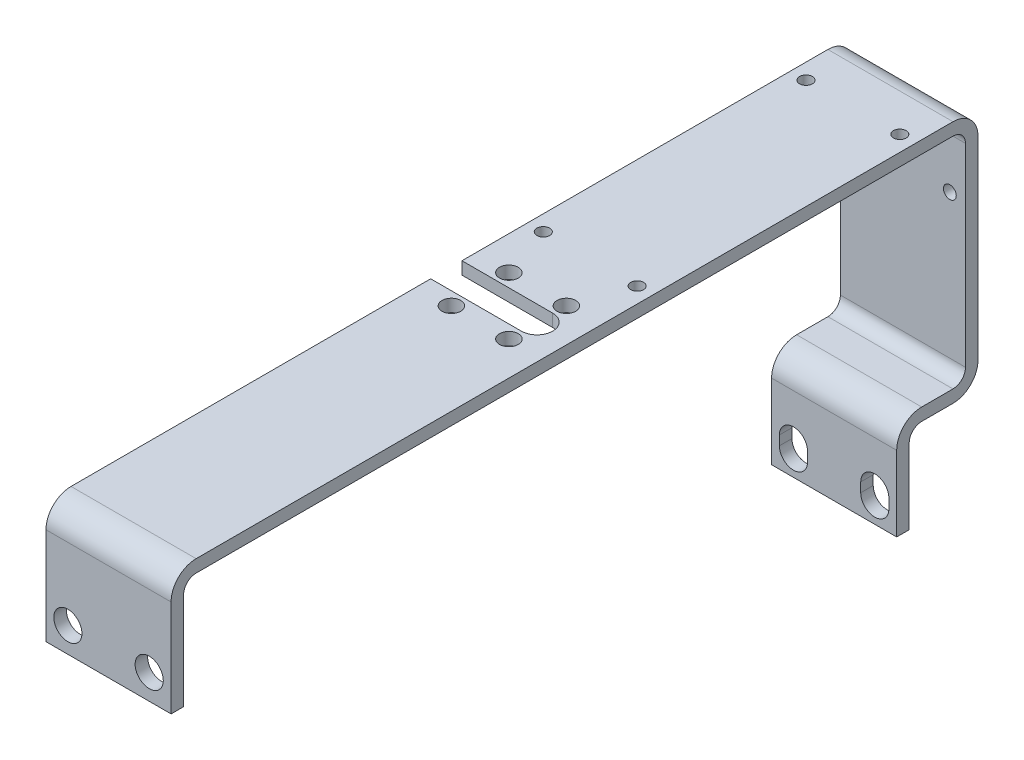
ISO-10303-21;
HEADER;
FILE_DESCRIPTION(('STEP AP214'),'2;1');
FILE_NAME('part.step','',(''),(''),'','','');
FILE_SCHEMA(('AUTOMOTIVE_DESIGN { 1 0 10303 214 1 1 1 1 }'));
ENDSEC;
DATA;
#1=APPLICATION_CONTEXT('core data for automotive mechanical design processes');
#2=APPLICATION_PROTOCOL_DEFINITION('international standard','automotive_design',2000,#1);
#3=PRODUCT_CONTEXT('',#1,'mechanical');
#4=PRODUCT('Part','Part','',(#3));
#5=PRODUCT_RELATED_PRODUCT_CATEGORY('part','',(#4));
#6=PRODUCT_DEFINITION_FORMATION('','',#4);
#7=PRODUCT_DEFINITION_CONTEXT('part definition',#1,'design');
#8=PRODUCT_DEFINITION('design','',#6,#7);
#9=PRODUCT_DEFINITION_SHAPE('','',#8);
#10=(LENGTH_UNIT() NAMED_UNIT(*) SI_UNIT(.MILLI.,.METRE.));
#11=(NAMED_UNIT(*) PLANE_ANGLE_UNIT() SI_UNIT($,.RADIAN.));
#12=(NAMED_UNIT(*) SI_UNIT($,.STERADIAN.) SOLID_ANGLE_UNIT());
#13=UNCERTAINTY_MEASURE_WITH_UNIT(LENGTH_MEASURE(1.E-05),#10,'distance_accuracy_value','');
#14=(GEOMETRIC_REPRESENTATION_CONTEXT(3) GLOBAL_UNCERTAINTY_ASSIGNED_CONTEXT((#13)) GLOBAL_UNIT_ASSIGNED_CONTEXT((#10,
#11,#12)) REPRESENTATION_CONTEXT('',''));
#15=CARTESIAN_POINT('',(0.,0.,0.));
#16=DIRECTION('',(0.,0.,1.));
#17=DIRECTION('',(1.,0.,0.));
#18=AXIS2_PLACEMENT_3D('',#15,#16,#17);
#19=CARTESIAN_POINT('',(0.,12.,-4.));
#20=DIRECTION('',(-1.,0.,0.));
#21=DIRECTION('',(0.,0.,1.));
#22=AXIS2_PLACEMENT_3D('',#19,#20,#21);
#23=PLANE('',#22);
#24=DIRECTION('',(0.,1.,0.));
#25=VECTOR('',#24,1.);
#26=CARTESIAN_POINT('',(0.,0.,49.5));
#27=LINE('',#26,#25);
#28=CARTESIAN_POINT('',(0.,51.,49.5));
#29=VERTEX_POINT('',#28);
#30=CARTESIAN_POINT('',(0.,53.,49.5));
#31=VERTEX_POINT('',#30);
#32=EDGE_CURVE('E254',#29,#31,#27,.T.);
#33=ORIENTED_EDGE('',*,*,#32,.T.);
#34=DIRECTION('',(0.,0.,1.));
#35=VECTOR('',#34,1.);
#36=CARTESIAN_POINT('',(0.,53.,-9.00000000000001));
#37=LINE('',#36,#35);
#38=CARTESIAN_POINT('',(0.,53.,-9.00000000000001));
#39=VERTEX_POINT('',#38);
#40=EDGE_CURVE('E268',#39,#31,#37,.T.);
#41=ORIENTED_EDGE('',*,*,#40,.F.);
#42=CARTESIAN_POINT('',(0.,49.,-9.00000000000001));
#43=DIRECTION('',(1.,0.,0.));
#44=DIRECTION('',(0.,0.,-1.));
#45=AXIS2_PLACEMENT_3D('',#42,#43,#44);
#46=CIRCLE('',#45,4.);
#47=CARTESIAN_POINT('',(0.,49.,-13.));
#48=VERTEX_POINT('',#47);
#49=EDGE_CURVE('E282',#48,#39,#46,.T.);
#50=ORIENTED_EDGE('',*,*,#49,.F.);
#51=DIRECTION('',(0.,1.,0.));
#52=VECTOR('',#51,1.);
#53=CARTESIAN_POINT('',(0.,49.,-13.));
#54=LINE('',#53,#52);
#55=CARTESIAN_POINT('',(0.,18.,-13.));
#56=VERTEX_POINT('',#55);
#57=EDGE_CURVE('E367',#56,#48,#54,.T.);
#58=ORIENTED_EDGE('',*,*,#57,.F.);
#59=CARTESIAN_POINT('',(0.,18.,-9.00000000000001));
#60=DIRECTION('',(1.,0.,0.));
#61=DIRECTION('',(0.,0.,1.));
#62=AXIS2_PLACEMENT_3D('',#59,#60,#61);
#63=CIRCLE('',#62,4.);
#64=CARTESIAN_POINT('',(0.,14.,-9.00000000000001));
#65=VERTEX_POINT('',#64);
#66=EDGE_CURVE('E366',#65,#56,#63,.T.);
#67=ORIENTED_EDGE('',*,*,#66,.F.);
#68=DIRECTION('',(0.,0.,-1.));
#69=VECTOR('',#68,1.);
#70=CARTESIAN_POINT('',(0.,14.,-9.00000000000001));
#71=LINE('',#70,#69);
#72=CARTESIAN_POINT('',(0.,14.,-4.));
#73=VERTEX_POINT('',#72);
#74=EDGE_CURVE('E364',#73,#65,#71,.T.);
#75=ORIENTED_EDGE('',*,*,#74,.F.);
#76=CARTESIAN_POINT('',(0.,12.,-4.));
#77=DIRECTION('',(-1.,0.,0.));
#78=DIRECTION('',(0.,0.,1.));
#79=AXIS2_PLACEMENT_3D('',#76,#77,#78);
#80=CIRCLE('',#79,2.);
#81=CARTESIAN_POINT('',(0.,12.,-2.));
#82=VERTEX_POINT('',#81);
#83=EDGE_CURVE('E355',#82,#73,#80,.T.);
#84=ORIENTED_EDGE('',*,*,#83,.F.);
#85=DIRECTION('',(0.,1.,0.));
#86=VECTOR('',#85,1.);
#87=CARTESIAN_POINT('',(0.,12.,-2.));
#88=LINE('',#87,#86);
#89=CARTESIAN_POINT('',(0.,0.,-2.));
#90=VERTEX_POINT('',#89);
#91=EDGE_CURVE('E344',#90,#82,#88,.T.);
#92=ORIENTED_EDGE('',*,*,#91,.F.);
#93=DIRECTION('',(0.,0.,-1.));
#94=VECTOR('',#93,1.);
#95=CARTESIAN_POINT('',(0.,0.,-2.));
#96=LINE('',#95,#94);
#97=CARTESIAN_POINT('',(0.,0.,0.));
#98=VERTEX_POINT('',#97);
#99=EDGE_CURVE('E350',#98,#90,#96,.T.);
#100=ORIENTED_EDGE('',*,*,#99,.F.);
#101=DIRECTION('',(0.,-1.,0.));
#102=VECTOR('',#101,1.);
#103=CARTESIAN_POINT('',(0.,0.,0.));
#104=LINE('',#103,#102);
#105=CARTESIAN_POINT('',(0.,12.,0.));
#106=VERTEX_POINT('',#105);
#107=EDGE_CURVE('E297',#106,#98,#104,.T.);
#108=ORIENTED_EDGE('',*,*,#107,.F.);
#109=CARTESIAN_POINT('',(0.,12.,-4.));
#110=DIRECTION('',(1.,0.,0.));
#111=DIRECTION('',(0.,0.,1.));
#112=AXIS2_PLACEMENT_3D('',#109,#110,#111);
#113=CIRCLE('',#112,4.);
#114=CARTESIAN_POINT('',(0.,16.,-4.));
#115=VERTEX_POINT('',#114);
#116=EDGE_CURVE('E295',#115,#106,#113,.T.);
#117=ORIENTED_EDGE('',*,*,#116,.F.);
#118=DIRECTION('',(0.,0.,1.));
#119=VECTOR('',#118,1.);
#120=CARTESIAN_POINT('',(0.,16.,-4.));
#121=LINE('',#120,#119);
#122=CARTESIAN_POINT('',(0.,16.,-9.00000000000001));
#123=VERTEX_POINT('',#122);
#124=EDGE_CURVE('E293',#123,#115,#121,.T.);
#125=ORIENTED_EDGE('',*,*,#124,.F.);
#126=CARTESIAN_POINT('',(0.,18.,-9.00000000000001));
#127=DIRECTION('',(-1.,0.,0.));
#128=DIRECTION('',(0.,0.,1.));
#129=AXIS2_PLACEMENT_3D('',#126,#127,#128);
#130=CIRCLE('',#129,2.);
#131=CARTESIAN_POINT('',(0.,18.,-11.));
#132=VERTEX_POINT('',#131);
#133=EDGE_CURVE('E291',#132,#123,#130,.T.);
#134=ORIENTED_EDGE('',*,*,#133,.F.);
#135=DIRECTION('',(0.,-1.,0.));
#136=VECTOR('',#135,1.);
#137=CARTESIAN_POINT('',(0.,18.,-11.));
#138=LINE('',#137,#136);
#139=CARTESIAN_POINT('',(0.,49.,-11.));
#140=VERTEX_POINT('',#139);
#141=EDGE_CURVE('E289',#140,#132,#138,.T.);
#142=ORIENTED_EDGE('',*,*,#141,.F.);
#143=CARTESIAN_POINT('',(0.,49.,-9.00000000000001));
#144=DIRECTION('',(-1.,0.,0.));
#145=DIRECTION('',(0.,0.,-1.));
#146=AXIS2_PLACEMENT_3D('',#143,#144,#145);
#147=CIRCLE('',#146,2.);
#148=CARTESIAN_POINT('',(0.,51.,-9.00000000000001));
#149=VERTEX_POINT('',#148);
#150=EDGE_CURVE('E287',#149,#140,#147,.T.);
#151=ORIENTED_EDGE('',*,*,#150,.F.);
#152=DIRECTION('',(0.,0.,-1.));
#153=VECTOR('',#152,1.);
#154=CARTESIAN_POINT('',(0.,51.,59.));
#155=LINE('',#154,#153);
#156=EDGE_CURVE('E270',#29,#149,#155,.T.);
#157=ORIENTED_EDGE('',*,*,#156,.F.);
#158=EDGE_LOOP('',(#33,#41,#50,#58,#67,#75,#84,#92,#100,#108,#117,#125,#134,#142,#151,#157));
#159=FACE_BOUND('',#158,.T.);
#160=ADVANCED_FACE('F39',(#159),#23,.T.);
#161=CARTESIAN_POINT('',(20.,0.,-2.));
#162=DIRECTION('',(0.,1.,0.));
#163=DIRECTION('',(0.,0.,1.));
#164=AXIS2_PLACEMENT_3D('',#161,#162,#163);
#165=PLANE('',#164);
#166=ORIENTED_EDGE('',*,*,#99,.T.);
#167=DIRECTION('',(-1.,0.,0.));
#168=VECTOR('',#167,1.);
#169=CARTESIAN_POINT('',(20.,0.,-2.));
#170=LINE('',#169,#168);
#171=CARTESIAN_POINT('',(20.,0.,-2.));
#172=VERTEX_POINT('',#171);
#173=EDGE_CURVE('E48',#172,#90,#170,.T.);
#174=ORIENTED_EDGE('',*,*,#173,.F.);
#175=DIRECTION('',(0.,0.,-1.));
#176=VECTOR('',#175,1.);
#177=CARTESIAN_POINT('',(20.,0.,-2.));
#178=LINE('',#177,#176);
#179=CARTESIAN_POINT('',(20.,0.,0.));
#180=VERTEX_POINT('',#179);
#181=EDGE_CURVE('E299',#180,#172,#178,.T.);
#182=ORIENTED_EDGE('',*,*,#181,.F.);
#183=DIRECTION('',(-1.,0.,0.));
#184=VECTOR('',#183,1.);
#185=CARTESIAN_POINT('',(20.,0.,0.));
#186=LINE('',#185,#184);
#187=EDGE_CURVE('E300',#180,#98,#186,.T.);
#188=ORIENTED_EDGE('',*,*,#187,.T.);
#189=EDGE_LOOP('',(#166,#174,#182,#188));
#190=FACE_BOUND('',#189,.T.);
#191=ADVANCED_FACE('F41',(#190),#165,.F.);
#192=CARTESIAN_POINT('',(20.,12.,-2.));
#193=DIRECTION('',(0.,0.,1.));
#194=DIRECTION('',(0.,-1.,0.));
#195=AXIS2_PLACEMENT_3D('',#192,#193,#194);
#196=PLANE('',#195);
#197=DIRECTION('',(0.,-1.,0.));
#198=VECTOR('',#197,1.);
#199=CARTESIAN_POINT('',(1.25,12.,-2.));
#200=LINE('',#199,#198);
#201=CARTESIAN_POINT('',(1.25,4.75,-2.));
#202=VERTEX_POINT('',#201);
#203=CARTESIAN_POINT('',(1.25,3.25,-2.));
#204=VERTEX_POINT('',#203);
#205=EDGE_CURVE('E963',#202,#204,#200,.T.);
#206=ORIENTED_EDGE('',*,*,#205,.T.);
#207=CARTESIAN_POINT('',(3.5,3.25,-2.));
#208=DIRECTION('',(0.,0.,1.));
#209=DIRECTION('',(0.,-1.,0.));
#210=AXIS2_PLACEMENT_3D('',#207,#208,#209);
#211=CIRCLE('',#210,2.25);
#212=CARTESIAN_POINT('',(5.75,3.25000000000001,-2.));
#213=VERTEX_POINT('',#212);
#214=EDGE_CURVE('E968',#204,#213,#211,.T.);
#215=ORIENTED_EDGE('',*,*,#214,.T.);
#216=DIRECTION('',(0.,1.,0.));
#217=VECTOR('',#216,1.);
#218=CARTESIAN_POINT('',(5.75,12.,-2.));
#219=LINE('',#218,#217);
#220=CARTESIAN_POINT('',(5.75,4.74999999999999,-2.));
#221=VERTEX_POINT('',#220);
#222=EDGE_CURVE('E953',#213,#221,#219,.T.);
#223=ORIENTED_EDGE('',*,*,#222,.T.);
#224=CARTESIAN_POINT('',(3.5,4.75,-2.));
#225=DIRECTION('',(0.,0.,1.));
#226=DIRECTION('',(0.,-1.,0.));
#227=AXIS2_PLACEMENT_3D('',#224,#225,#226);
#228=CIRCLE('',#227,2.25);
#229=EDGE_CURVE('E965',#221,#202,#228,.T.);
#230=ORIENTED_EDGE('',*,*,#229,.T.);
#231=EDGE_LOOP('',(#206,#215,#223,#230));
#232=FACE_BOUND('',#231,.T.);
#233=DIRECTION('',(0.,-1.,0.));
#234=VECTOR('',#233,1.);
#235=CARTESIAN_POINT('',(14.25,12.,-2.));
#236=LINE('',#235,#234);
#237=CARTESIAN_POINT('',(14.25,4.75,-2.));
#238=VERTEX_POINT('',#237);
#239=CARTESIAN_POINT('',(14.25,3.25000000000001,-2.));
#240=VERTEX_POINT('',#239);
#241=EDGE_CURVE('E935',#238,#240,#236,.T.);
#242=ORIENTED_EDGE('',*,*,#241,.T.);
#243=CARTESIAN_POINT('',(16.5,3.25,-2.));
#244=DIRECTION('',(0.,0.,1.));
#245=DIRECTION('',(0.,-1.,0.));
#246=AXIS2_PLACEMENT_3D('',#243,#244,#245);
#247=CIRCLE('',#246,2.25);
#248=CARTESIAN_POINT('',(18.75,3.25000000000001,-2.));
#249=VERTEX_POINT('',#248);
#250=EDGE_CURVE('E939',#240,#249,#247,.T.);
#251=ORIENTED_EDGE('',*,*,#250,.T.);
#252=DIRECTION('',(0.,1.,0.));
#253=VECTOR('',#252,1.);
#254=CARTESIAN_POINT('',(18.75,12.,-2.));
#255=LINE('',#254,#253);
#256=CARTESIAN_POINT('',(18.75,4.75,-2.));
#257=VERTEX_POINT('',#256);
#258=EDGE_CURVE('E55',#249,#257,#255,.T.);
#259=ORIENTED_EDGE('',*,*,#258,.T.);
#260=CARTESIAN_POINT('',(16.5,4.75,-2.));
#261=DIRECTION('',(0.,0.,1.));
#262=DIRECTION('',(0.,-1.,0.));
#263=AXIS2_PLACEMENT_3D('',#260,#261,#262);
#264=CIRCLE('',#263,2.25);
#265=EDGE_CURVE('E937',#257,#238,#264,.T.);
#266=ORIENTED_EDGE('',*,*,#265,.T.);
#267=EDGE_LOOP('',(#242,#251,#259,#266));
#268=FACE_BOUND('',#267,.T.);
#269=ORIENTED_EDGE('',*,*,#91,.T.);
#270=DIRECTION('',(-1.,0.,0.));
#271=VECTOR('',#270,1.);
#272=CARTESIAN_POINT('',(20.,12.,-2.));
#273=LINE('',#272,#271);
#274=CARTESIAN_POINT('',(20.,12.,-2.));
#275=VERTEX_POINT('',#274);
#276=EDGE_CURVE('E335',#275,#82,#273,.T.);
#277=ORIENTED_EDGE('',*,*,#276,.F.);
#278=DIRECTION('',(0.,1.,0.));
#279=VECTOR('',#278,1.);
#280=CARTESIAN_POINT('',(20.,12.,-2.));
#281=LINE('',#280,#279);
#282=EDGE_CURVE('E345',#172,#275,#281,.T.);
#283=ORIENTED_EDGE('',*,*,#282,.F.);
#284=ORIENTED_EDGE('',*,*,#173,.T.);
#285=EDGE_LOOP('',(#269,#277,#283,#284));
#286=FACE_BOUND('',#285,.T.);
#287=ADVANCED_FACE('F342',(#232,#268,#286),#196,.F.);
#288=CARTESIAN_POINT('',(20.,12.,-4.));
#289=DIRECTION('',(-1.,0.,0.));
#290=DIRECTION('',(0.,0.,1.));
#291=AXIS2_PLACEMENT_3D('',#288,#289,#290);
#292=CYLINDRICAL_SURFACE('',#291,2.);
#293=ORIENTED_EDGE('',*,*,#83,.T.);
#294=DIRECTION('',(-1.,0.,0.));
#295=VECTOR('',#294,1.);
#296=CARTESIAN_POINT('',(20.,14.,-4.));
#297=LINE('',#296,#295);
#298=CARTESIAN_POINT('',(20.,14.,-4.));
#299=VERTEX_POINT('',#298);
#300=EDGE_CURVE('E332',#299,#73,#297,.T.);
#301=ORIENTED_EDGE('',*,*,#300,.F.);
#302=CARTESIAN_POINT('',(20.,12.,-4.));
#303=DIRECTION('',(-1.,0.,0.));
#304=DIRECTION('',(0.,0.,1.));
#305=AXIS2_PLACEMENT_3D('',#302,#303,#304);
#306=CIRCLE('',#305,2.);
#307=EDGE_CURVE('E413',#275,#299,#306,.T.);
#308=ORIENTED_EDGE('',*,*,#307,.F.);
#309=ORIENTED_EDGE('',*,*,#276,.T.);
#310=EDGE_LOOP('',(#293,#301,#308,#309));
#311=FACE_BOUND('',#310,.T.);
#312=ADVANCED_FACE('F423',(#311),#292,.F.);
#313=CARTESIAN_POINT('',(20.,14.,-9.00000000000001));
#314=DIRECTION('',(0.,1.,0.));
#315=DIRECTION('',(0.,0.,1.));
#316=AXIS2_PLACEMENT_3D('',#313,#314,#315);
#317=PLANE('',#316);
#318=ORIENTED_EDGE('',*,*,#74,.T.);
#319=DIRECTION('',(-1.,0.,0.));
#320=VECTOR('',#319,1.);
#321=CARTESIAN_POINT('',(20.,14.,-9.00000000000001));
#322=LINE('',#321,#320);
#323=CARTESIAN_POINT('',(20.,14.,-9.00000000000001));
#324=VERTEX_POINT('',#323);
#325=EDGE_CURVE('E329',#324,#65,#322,.T.);
#326=ORIENTED_EDGE('',*,*,#325,.F.);
#327=DIRECTION('',(0.,0.,-1.));
#328=VECTOR('',#327,1.);
#329=CARTESIAN_POINT('',(20.,14.,-9.00000000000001));
#330=LINE('',#329,#328);
#331=EDGE_CURVE('E391',#299,#324,#330,.T.);
#332=ORIENTED_EDGE('',*,*,#331,.F.);
#333=ORIENTED_EDGE('',*,*,#300,.T.);
#334=EDGE_LOOP('',(#318,#326,#332,#333));
#335=FACE_BOUND('',#334,.T.);
#336=ADVANCED_FACE('F421',(#335),#317,.F.);
#337=CARTESIAN_POINT('',(20.,18.,-9.00000000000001));
#338=DIRECTION('',(-1.,0.,0.));
#339=DIRECTION('',(0.,0.,1.));
#340=AXIS2_PLACEMENT_3D('',#337,#338,#339);
#341=CYLINDRICAL_SURFACE('',#340,4.);
#342=ORIENTED_EDGE('',*,*,#66,.T.);
#343=DIRECTION('',(-1.,0.,0.));
#344=VECTOR('',#343,1.);
#345=CARTESIAN_POINT('',(20.,18.,-13.));
#346=LINE('',#345,#344);
#347=CARTESIAN_POINT('',(20.,18.,-13.));
#348=VERTEX_POINT('',#347);
#349=EDGE_CURVE('E326',#348,#56,#346,.T.);
#350=ORIENTED_EDGE('',*,*,#349,.F.);
#351=CARTESIAN_POINT('',(20.,18.,-9.00000000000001));
#352=DIRECTION('',(1.,0.,0.));
#353=DIRECTION('',(0.,0.,1.));
#354=AXIS2_PLACEMENT_3D('',#351,#352,#353);
#355=CIRCLE('',#354,4.);
#356=EDGE_CURVE('E387',#324,#348,#355,.T.);
#357=ORIENTED_EDGE('',*,*,#356,.F.);
#358=ORIENTED_EDGE('',*,*,#325,.T.);
#359=EDGE_LOOP('',(#342,#350,#357,#358));
#360=FACE_BOUND('',#359,.T.);
#361=ADVANCED_FACE('F379',(#360),#341,.T.);
#362=CARTESIAN_POINT('',(20.,49.,-13.));
#363=DIRECTION('',(0.,0.,1.));
#364=DIRECTION('',(0.,-1.,0.));
#365=AXIS2_PLACEMENT_3D('',#362,#363,#364);
#366=PLANE('',#365);
#367=CARTESIAN_POINT('',(17.5,41.,-13.));
#368=DIRECTION('',(0.,0.,-1.));
#369=DIRECTION('',(0.,1.,0.));
#370=AXIS2_PLACEMENT_3D('',#367,#368,#369);
#371=CIRCLE('',#370,1.02499999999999);
#372=CARTESIAN_POINT('',(17.5,42.025,-13.));
#373=VERTEX_POINT('',#372);
#374=EDGE_CURVE('E468',#373,#373,#371,.T.);
#375=ORIENTED_EDGE('',*,*,#374,.F.);
#376=EDGE_LOOP('',(#375));
#377=FACE_BOUND('',#376,.T.);
#378=CARTESIAN_POINT('',(2.5,41.,-13.));
#379=DIRECTION('',(0.,0.,-1.));
#380=DIRECTION('',(0.,1.,0.));
#381=AXIS2_PLACEMENT_3D('',#378,#379,#380);
#382=CIRCLE('',#381,1.02499999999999);
#383=CARTESIAN_POINT('',(2.5,42.025,-13.));
#384=VERTEX_POINT('',#383);
#385=EDGE_CURVE('E507',#384,#384,#382,.T.);
#386=ORIENTED_EDGE('',*,*,#385,.F.);
#387=EDGE_LOOP('',(#386));
#388=FACE_BOUND('',#387,.T.);
#389=ORIENTED_EDGE('',*,*,#57,.T.);
#390=DIRECTION('',(-1.,0.,0.));
#391=VECTOR('',#390,1.);
#392=CARTESIAN_POINT('',(20.,49.,-13.));
#393=LINE('',#392,#391);
#394=CARTESIAN_POINT('',(20.,49.,-13.));
#395=VERTEX_POINT('',#394);
#396=EDGE_CURVE('E323',#395,#48,#393,.T.);
#397=ORIENTED_EDGE('',*,*,#396,.F.);
#398=DIRECTION('',(0.,1.,0.));
#399=VECTOR('',#398,1.);
#400=CARTESIAN_POINT('',(20.,49.,-13.));
#401=LINE('',#400,#399);
#402=EDGE_CURVE('E384',#348,#395,#401,.T.);
#403=ORIENTED_EDGE('',*,*,#402,.F.);
#404=ORIENTED_EDGE('',*,*,#349,.T.);
#405=EDGE_LOOP('',(#389,#397,#403,#404));
#406=FACE_BOUND('',#405,.T.);
#407=ADVANCED_FACE('F383',(#377,#388,#406),#366,.F.);
#408=CARTESIAN_POINT('',(20.,49.,-9.00000000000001));
#409=DIRECTION('',(-1.,0.,0.));
#410=DIRECTION('',(0.,0.,1.));
#411=AXIS2_PLACEMENT_3D('',#408,#409,#410);
#412=CYLINDRICAL_SURFACE('',#411,4.);
#413=ORIENTED_EDGE('',*,*,#49,.T.);
#414=DIRECTION('',(-1.,0.,0.));
#415=VECTOR('',#414,1.);
#416=CARTESIAN_POINT('',(20.,53.,-9.00000000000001));
#417=LINE('',#416,#415);
#418=CARTESIAN_POINT('',(20.,53.,-9.00000000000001));
#419=VERTEX_POINT('',#418);
#420=EDGE_CURVE('E277',#419,#39,#417,.T.);
#421=ORIENTED_EDGE('',*,*,#420,.F.);
#422=CARTESIAN_POINT('',(20.,49.,-9.00000000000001));
#423=DIRECTION('',(1.,0.,0.));
#424=DIRECTION('',(0.,0.,-1.));
#425=AXIS2_PLACEMENT_3D('',#422,#423,#424);
#426=CIRCLE('',#425,4.);
#427=EDGE_CURVE('E386',#395,#419,#426,.T.);
#428=ORIENTED_EDGE('',*,*,#427,.F.);
#429=ORIENTED_EDGE('',*,*,#396,.T.);
#430=EDGE_LOOP('',(#413,#421,#428,#429));
#431=FACE_BOUND('',#430,.T.);
#432=ADVANCED_FACE('F372',(#431),#412,.T.);
#433=CARTESIAN_POINT('',(20.,53.,-9.00000000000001));
#434=DIRECTION('',(0.,-1.,0.));
#435=DIRECTION('',(0.,0.,-1.));
#436=AXIS2_PLACEMENT_3D('',#433,#434,#435);
#437=PLANE('',#436);
#438=CARTESIAN_POINT('',(14.5961940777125,53.,47.4038059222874));
#439=DIRECTION('',(0.,1.,0.));
#440=DIRECTION('',(0.,0.,1.));
#441=AXIS2_PLACEMENT_3D('',#438,#439,#440);
#442=CIRCLE('',#441,1.49999999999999);
#443=CARTESIAN_POINT('',(14.5961940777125,53.,48.9038059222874));
#444=VERTEX_POINT('',#443);
#445=EDGE_CURVE('E971',#444,#444,#442,.T.);
#446=ORIENTED_EDGE('',*,*,#445,.F.);
#447=EDGE_LOOP('',(#446));
#448=FACE_BOUND('',#447,.T.);
#449=CARTESIAN_POINT('',(14.5961940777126,53.,56.5961940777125));
#450=DIRECTION('',(0.,1.,0.));
#451=DIRECTION('',(0.,0.,1.));
#452=AXIS2_PLACEMENT_3D('',#449,#450,#451);
#453=CIRCLE('',#452,1.49999999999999);
#454=CARTESIAN_POINT('',(14.5961940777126,53.,58.0961940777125));
#455=VERTEX_POINT('',#454);
#456=EDGE_CURVE('E974',#455,#455,#453,.T.);
#457=ORIENTED_EDGE('',*,*,#456,.F.);
#458=EDGE_LOOP('',(#457));
#459=FACE_BOUND('',#458,.T.);
#460=CARTESIAN_POINT('',(5.40380592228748,53.,56.5961940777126));
#461=DIRECTION('',(0.,1.,0.));
#462=DIRECTION('',(0.,0.,1.));
#463=AXIS2_PLACEMENT_3D('',#460,#461,#462);
#464=CIRCLE('',#463,1.49999999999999);
#465=CARTESIAN_POINT('',(5.40380592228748,53.,58.0961940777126));
#466=VERTEX_POINT('',#465);
#467=EDGE_CURVE('E980',#466,#466,#464,.T.);
#468=ORIENTED_EDGE('',*,*,#467,.F.);
#469=EDGE_LOOP('',(#468));
#470=FACE_BOUND('',#469,.T.);
#471=CARTESIAN_POINT('',(5.40380592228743,53.,47.4038059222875));
#472=DIRECTION('',(0.,1.,0.));
#473=DIRECTION('',(0.,0.,1.));
#474=AXIS2_PLACEMENT_3D('',#471,#472,#473);
#475=CIRCLE('',#474,1.49999999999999);
#476=CARTESIAN_POINT('',(5.40380592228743,53.,48.9038059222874));
#477=VERTEX_POINT('',#476);
#478=EDGE_CURVE('E986',#477,#477,#475,.T.);
#479=ORIENTED_EDGE('',*,*,#478,.F.);
#480=EDGE_LOOP('',(#479));
#481=FACE_BOUND('',#480,.T.);
#482=CARTESIAN_POINT('',(17.5,53.,39.));
#483=DIRECTION('',(0.,1.,0.));
#484=DIRECTION('',(0.,0.,1.));
#485=AXIS2_PLACEMENT_3D('',#482,#483,#484);
#486=CIRCLE('',#485,1.02499999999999);
#487=CARTESIAN_POINT('',(17.5,53.,40.025));
#488=VERTEX_POINT('',#487);
#489=EDGE_CURVE('E513',#488,#488,#486,.T.);
#490=ORIENTED_EDGE('',*,*,#489,.F.);
#491=EDGE_LOOP('',(#490));
#492=FACE_BOUND('',#491,.T.);
#493=CARTESIAN_POINT('',(2.5,53.,39.));
#494=DIRECTION('',(0.,1.,0.));
#495=DIRECTION('',(0.,0.,1.));
#496=AXIS2_PLACEMENT_3D('',#493,#494,#495);
#497=CIRCLE('',#496,1.02499999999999);
#498=CARTESIAN_POINT('',(2.5,53.,40.025));
#499=VERTEX_POINT('',#498);
#500=EDGE_CURVE('E519',#499,#499,#497,.T.);
#501=ORIENTED_EDGE('',*,*,#500,.F.);
#502=EDGE_LOOP('',(#501));
#503=FACE_BOUND('',#502,.T.);
#504=CARTESIAN_POINT('',(17.5,53.,-3.00000000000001));
#505=DIRECTION('',(0.,1.,0.));
#506=DIRECTION('',(0.,0.,1.));
#507=AXIS2_PLACEMENT_3D('',#504,#505,#506);
#508=CIRCLE('',#507,1.02499999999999);
#509=CARTESIAN_POINT('',(17.5,53.,-1.97500000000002));
#510=VERTEX_POINT('',#509);
#511=EDGE_CURVE('E525',#510,#510,#508,.T.);
#512=ORIENTED_EDGE('',*,*,#511,.F.);
#513=EDGE_LOOP('',(#512));
#514=FACE_BOUND('',#513,.T.);
#515=CARTESIAN_POINT('',(2.49999999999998,53.,-3.00000000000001));
#516=DIRECTION('',(0.,1.,0.));
#517=DIRECTION('',(0.,0.,1.));
#518=AXIS2_PLACEMENT_3D('',#515,#516,#517);
#519=CIRCLE('',#518,1.02499999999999);
#520=CARTESIAN_POINT('',(2.49999999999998,53.,-1.97500000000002));
#521=VERTEX_POINT('',#520);
#522=EDGE_CURVE('E358',#521,#521,#519,.T.);
#523=ORIENTED_EDGE('',*,*,#522,.F.);
#524=EDGE_LOOP('',(#523));
#525=FACE_BOUND('',#524,.T.);
#526=DIRECTION('',(1.,0.,0.));
#527=VECTOR('',#526,1.);
#528=CARTESIAN_POINT('',(5.5,53.,54.5));
#529=LINE('',#528,#527);
#530=CARTESIAN_POINT('',(0.,53.,54.5));
#531=VERTEX_POINT('',#530);
#532=CARTESIAN_POINT('',(14.5,53.,54.5));
#533=VERTEX_POINT('',#532);
#534=EDGE_CURVE('E992',#531,#533,#529,.T.);
#535=ORIENTED_EDGE('',*,*,#534,.F.);
#536=CARTESIAN_POINT('',(0.,53.,112.));
#537=VERTEX_POINT('',#536);
#538=EDGE_CURVE('E278',#531,#537,#37,.T.);
#539=ORIENTED_EDGE('',*,*,#538,.T.);
#540=DIRECTION('',(1.,0.,0.));
#541=VECTOR('',#540,1.);
#542=CARTESIAN_POINT('',(-60.2432568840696,53.,112.));
#543=LINE('',#542,#541);
#544=CARTESIAN_POINT('',(20.,53.,112.));
#545=VERTEX_POINT('',#544);
#546=EDGE_CURVE('E494',#537,#545,#543,.T.);
#547=ORIENTED_EDGE('',*,*,#546,.T.);
#548=DIRECTION('',(0.,0.,1.));
#549=VECTOR('',#548,1.);
#550=CARTESIAN_POINT('',(20.,53.,-9.00000000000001));
#551=LINE('',#550,#549);
#552=EDGE_CURVE('E389',#419,#545,#551,.T.);
#553=ORIENTED_EDGE('',*,*,#552,.F.);
#554=ORIENTED_EDGE('',*,*,#420,.T.);
#555=ORIENTED_EDGE('',*,*,#40,.T.);
#556=DIRECTION('',(-1.,0.,0.));
#557=VECTOR('',#556,1.);
#558=CARTESIAN_POINT('',(5.5,53.,49.5));
#559=LINE('',#558,#557);
#560=CARTESIAN_POINT('',(14.5,53.,49.5));
#561=VERTEX_POINT('',#560);
#562=EDGE_CURVE('E251',#561,#31,#559,.T.);
#563=ORIENTED_EDGE('',*,*,#562,.F.);
#564=CARTESIAN_POINT('',(14.5,53.,52.));
#565=DIRECTION('',(0.,1.,0.));
#566=DIRECTION('',(0.,0.,1.));
#567=AXIS2_PLACEMENT_3D('',#564,#565,#566);
#568=CIRCLE('',#567,2.5);
#569=EDGE_CURVE('E263',#533,#561,#568,.T.);
#570=ORIENTED_EDGE('',*,*,#569,.F.);
#571=EDGE_LOOP('',(#535,#539,#547,#553,#554,#555,#563,#570));
#572=FACE_BOUND('',#571,.T.);
#573=ADVANCED_FACE('F274',(#448,#459,#470,#481,#492,#503,#514,#525,#572),#437,.F.);
#574=CARTESIAN_POINT('',(20.,51.,59.));
#575=DIRECTION('',(0.,1.,0.));
#576=DIRECTION('',(0.,0.,1.));
#577=AXIS2_PLACEMENT_3D('',#574,#575,#576);
#578=PLANE('',#577);
#579=CARTESIAN_POINT('',(14.5961940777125,51.,47.4038059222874));
#580=DIRECTION('',(0.,1.,0.));
#581=DIRECTION('',(0.,0.,1.));
#582=AXIS2_PLACEMENT_3D('',#579,#580,#581);
#583=CIRCLE('',#582,1.49999999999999);
#584=CARTESIAN_POINT('',(14.5961940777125,51.,48.9038059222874));
#585=VERTEX_POINT('',#584);
#586=EDGE_CURVE('E43',#585,#585,#583,.T.);
#587=ORIENTED_EDGE('',*,*,#586,.T.);
#588=EDGE_LOOP('',(#587));
#589=FACE_BOUND('',#588,.T.);
#590=CARTESIAN_POINT('',(14.5961940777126,51.,56.5961940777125));
#591=DIRECTION('',(0.,1.,0.));
#592=DIRECTION('',(0.,0.,1.));
#593=AXIS2_PLACEMENT_3D('',#590,#591,#592);
#594=CIRCLE('',#593,1.49999999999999);
#595=CARTESIAN_POINT('',(14.5961940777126,51.,58.0961940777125));
#596=VERTEX_POINT('',#595);
#597=EDGE_CURVE('E977',#596,#596,#594,.T.);
#598=ORIENTED_EDGE('',*,*,#597,.T.);
#599=EDGE_LOOP('',(#598));
#600=FACE_BOUND('',#599,.T.);
#601=CARTESIAN_POINT('',(5.40380592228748,51.,56.5961940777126));
#602=DIRECTION('',(0.,1.,0.));
#603=DIRECTION('',(0.,0.,1.));
#604=AXIS2_PLACEMENT_3D('',#601,#602,#603);
#605=CIRCLE('',#604,1.49999999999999);
#606=CARTESIAN_POINT('',(5.40380592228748,51.,58.0961940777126));
#607=VERTEX_POINT('',#606);
#608=EDGE_CURVE('E983',#607,#607,#605,.T.);
#609=ORIENTED_EDGE('',*,*,#608,.T.);
#610=EDGE_LOOP('',(#609));
#611=FACE_BOUND('',#610,.T.);
#612=CARTESIAN_POINT('',(5.40380592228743,51.,47.4038059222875));
#613=DIRECTION('',(0.,1.,0.));
#614=DIRECTION('',(0.,0.,1.));
#615=AXIS2_PLACEMENT_3D('',#612,#613,#614);
#616=CIRCLE('',#615,1.49999999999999);
#617=CARTESIAN_POINT('',(5.40380592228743,51.,48.9038059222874));
#618=VERTEX_POINT('',#617);
#619=EDGE_CURVE('E989',#618,#618,#616,.T.);
#620=ORIENTED_EDGE('',*,*,#619,.T.);
#621=EDGE_LOOP('',(#620));
#622=FACE_BOUND('',#621,.T.);
#623=CARTESIAN_POINT('',(17.5,51.,39.));
#624=DIRECTION('',(0.,1.,0.));
#625=DIRECTION('',(0.,0.,1.));
#626=AXIS2_PLACEMENT_3D('',#623,#624,#625);
#627=CIRCLE('',#626,1.02499999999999);
#628=CARTESIAN_POINT('',(17.5,51.,40.025));
#629=VERTEX_POINT('',#628);
#630=EDGE_CURVE('E516',#629,#629,#627,.T.);
#631=ORIENTED_EDGE('',*,*,#630,.T.);
#632=EDGE_LOOP('',(#631));
#633=FACE_BOUND('',#632,.T.);
#634=CARTESIAN_POINT('',(2.5,51.,39.));
#635=DIRECTION('',(0.,1.,0.));
#636=DIRECTION('',(0.,0.,1.));
#637=AXIS2_PLACEMENT_3D('',#634,#635,#636);
#638=CIRCLE('',#637,1.02499999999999);
#639=CARTESIAN_POINT('',(2.5,51.,40.025));
#640=VERTEX_POINT('',#639);
#641=EDGE_CURVE('E522',#640,#640,#638,.T.);
#642=ORIENTED_EDGE('',*,*,#641,.T.);
#643=EDGE_LOOP('',(#642));
#644=FACE_BOUND('',#643,.T.);
#645=CARTESIAN_POINT('',(17.5,51.,-3.00000000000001));
#646=DIRECTION('',(0.,1.,0.));
#647=DIRECTION('',(0.,0.,1.));
#648=AXIS2_PLACEMENT_3D('',#645,#646,#647);
#649=CIRCLE('',#648,1.02499999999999);
#650=CARTESIAN_POINT('',(17.5,51.,-1.97500000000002));
#651=VERTEX_POINT('',#650);
#652=EDGE_CURVE('E528',#651,#651,#649,.T.);
#653=ORIENTED_EDGE('',*,*,#652,.T.);
#654=EDGE_LOOP('',(#653));
#655=FACE_BOUND('',#654,.T.);
#656=CARTESIAN_POINT('',(2.49999999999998,51.,-3.00000000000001));
#657=DIRECTION('',(0.,1.,0.));
#658=DIRECTION('',(0.,0.,1.));
#659=AXIS2_PLACEMENT_3D('',#656,#657,#658);
#660=CIRCLE('',#659,1.02499999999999);
#661=CARTESIAN_POINT('',(2.49999999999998,51.,-1.97500000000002));
#662=VERTEX_POINT('',#661);
#663=EDGE_CURVE('E353',#662,#662,#660,.T.);
#664=ORIENTED_EDGE('',*,*,#663,.T.);
#665=EDGE_LOOP('',(#664));
#666=FACE_BOUND('',#665,.T.);
#667=CARTESIAN_POINT('',(0.,51.,112.));
#668=VERTEX_POINT('',#667);
#669=CARTESIAN_POINT('',(0.,51.,54.5));
#670=VERTEX_POINT('',#669);
#671=EDGE_CURVE('E280',#668,#670,#155,.T.);
#672=ORIENTED_EDGE('',*,*,#671,.T.);
#673=DIRECTION('',(1.,0.,0.));
#674=VECTOR('',#673,1.);
#675=CARTESIAN_POINT('',(20.,51.,54.5));
#676=LINE('',#675,#674);
#677=CARTESIAN_POINT('',(14.5,51.,54.5));
#678=VERTEX_POINT('',#677);
#679=EDGE_CURVE('E459',#670,#678,#676,.T.);
#680=ORIENTED_EDGE('',*,*,#679,.T.);
#681=CARTESIAN_POINT('',(14.5,51.,52.));
#682=DIRECTION('',(0.,1.,0.));
#683=DIRECTION('',(0.,0.,1.));
#684=AXIS2_PLACEMENT_3D('',#681,#682,#683);
#685=CIRCLE('',#684,2.5);
#686=CARTESIAN_POINT('',(14.5,51.,49.5));
#687=VERTEX_POINT('',#686);
#688=EDGE_CURVE('E11',#678,#687,#685,.T.);
#689=ORIENTED_EDGE('',*,*,#688,.T.);
#690=DIRECTION('',(-1.,0.,0.));
#691=VECTOR('',#690,1.);
#692=CARTESIAN_POINT('',(20.,51.,49.5));
#693=LINE('',#692,#691);
#694=EDGE_CURVE('E999',#687,#29,#693,.T.);
#695=ORIENTED_EDGE('',*,*,#694,.T.);
#696=ORIENTED_EDGE('',*,*,#156,.T.);
#697=DIRECTION('',(-1.,0.,0.));
#698=VECTOR('',#697,1.);
#699=CARTESIAN_POINT('',(20.,51.,-9.00000000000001));
#700=LINE('',#699,#698);
#701=CARTESIAN_POINT('',(20.,51.,-9.00000000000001));
#702=VERTEX_POINT('',#701);
#703=EDGE_CURVE('E319',#702,#149,#700,.T.);
#704=ORIENTED_EDGE('',*,*,#703,.F.);
#705=DIRECTION('',(0.,0.,-1.));
#706=VECTOR('',#705,1.);
#707=CARTESIAN_POINT('',(20.,51.,59.));
#708=LINE('',#707,#706);
#709=CARTESIAN_POINT('',(20.,51.,112.));
#710=VERTEX_POINT('',#709);
#711=EDGE_CURVE('E396',#710,#702,#708,.T.);
#712=ORIENTED_EDGE('',*,*,#711,.F.);
#713=DIRECTION('',(1.,0.,0.));
#714=VECTOR('',#713,1.);
#715=CARTESIAN_POINT('',(-60.2432568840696,51.,112.));
#716=LINE('',#715,#714);
#717=EDGE_CURVE('E462',#668,#710,#716,.T.);
#718=ORIENTED_EDGE('',*,*,#717,.F.);
#719=EDGE_LOOP('',(#672,#680,#689,#695,#696,#704,#712,#718));
#720=FACE_BOUND('',#719,.T.);
#721=ADVANCED_FACE('F458',(#589,#600,#611,#622,#633,#644,#655,#666,#720),#578,.F.);
#722=CARTESIAN_POINT('',(20.,49.,-9.00000000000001));
#723=DIRECTION('',(-1.,0.,0.));
#724=DIRECTION('',(0.,0.,1.));
#725=AXIS2_PLACEMENT_3D('',#722,#723,#724);
#726=CYLINDRICAL_SURFACE('',#725,2.);
#727=ORIENTED_EDGE('',*,*,#150,.T.);
#728=DIRECTION('',(-1.,0.,0.));
#729=VECTOR('',#728,1.);
#730=CARTESIAN_POINT('',(20.,49.,-11.));
#731=LINE('',#730,#729);
#732=CARTESIAN_POINT('',(20.,49.,-11.));
#733=VERTEX_POINT('',#732);
#734=EDGE_CURVE('E316',#733,#140,#731,.T.);
#735=ORIENTED_EDGE('',*,*,#734,.F.);
#736=CARTESIAN_POINT('',(20.,49.,-9.00000000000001));
#737=DIRECTION('',(-1.,0.,0.));
#738=DIRECTION('',(0.,0.,-1.));
#739=AXIS2_PLACEMENT_3D('',#736,#737,#738);
#740=CIRCLE('',#739,2.);
#741=EDGE_CURVE('E398',#702,#733,#740,.T.);
#742=ORIENTED_EDGE('',*,*,#741,.F.);
#743=ORIENTED_EDGE('',*,*,#703,.T.);
#744=EDGE_LOOP('',(#727,#735,#742,#743));
#745=FACE_BOUND('',#744,.T.);
#746=ADVANCED_FACE('F541',(#745),#726,.F.);
#747=CARTESIAN_POINT('',(20.,18.,-11.));
#748=DIRECTION('',(0.,0.,-1.));
#749=DIRECTION('',(-1.,0.,0.));
#750=AXIS2_PLACEMENT_3D('',#747,#748,#749);
#751=PLANE('',#750);
#752=CARTESIAN_POINT('',(17.5,41.,-11.));
#753=DIRECTION('',(0.,0.,-1.));
#754=DIRECTION('',(-1.,0.,0.));
#755=AXIS2_PLACEMENT_3D('',#752,#753,#754);
#756=CIRCLE('',#755,1.02499999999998);
#757=CARTESIAN_POINT('',(16.475,41.,-11.));
#758=VERTEX_POINT('',#757);
#759=EDGE_CURVE('E504',#758,#758,#756,.T.);
#760=ORIENTED_EDGE('',*,*,#759,.T.);
#761=EDGE_LOOP('',(#760));
#762=FACE_BOUND('',#761,.T.);
#763=CARTESIAN_POINT('',(2.5,41.,-11.));
#764=DIRECTION('',(0.,0.,-1.));
#765=DIRECTION('',(-1.,0.,0.));
#766=AXIS2_PLACEMENT_3D('',#763,#764,#765);
#767=CIRCLE('',#766,1.02499999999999);
#768=CARTESIAN_POINT('',(1.47500000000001,41.,-11.));
#769=VERTEX_POINT('',#768);
#770=EDGE_CURVE('E510',#769,#769,#767,.T.);
#771=ORIENTED_EDGE('',*,*,#770,.T.);
#772=EDGE_LOOP('',(#771));
#773=FACE_BOUND('',#772,.T.);
#774=ORIENTED_EDGE('',*,*,#141,.T.);
#775=DIRECTION('',(-1.,0.,0.));
#776=VECTOR('',#775,1.);
#777=CARTESIAN_POINT('',(20.,18.,-11.));
#778=LINE('',#777,#776);
#779=CARTESIAN_POINT('',(20.,18.,-11.));
#780=VERTEX_POINT('',#779);
#781=EDGE_CURVE('E313',#780,#132,#778,.T.);
#782=ORIENTED_EDGE('',*,*,#781,.F.);
#783=DIRECTION('',(0.,-1.,0.));
#784=VECTOR('',#783,1.);
#785=CARTESIAN_POINT('',(20.,18.,-11.));
#786=LINE('',#785,#784);
#787=EDGE_CURVE('E400',#733,#780,#786,.T.);
#788=ORIENTED_EDGE('',*,*,#787,.F.);
#789=ORIENTED_EDGE('',*,*,#734,.T.);
#790=EDGE_LOOP('',(#774,#782,#788,#789));
#791=FACE_BOUND('',#790,.T.);
#792=ADVANCED_FACE('F577',(#762,#773,#791),#751,.F.);
#793=CARTESIAN_POINT('',(20.,18.,-9.00000000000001));
#794=DIRECTION('',(-1.,0.,0.));
#795=DIRECTION('',(0.,0.,1.));
#796=AXIS2_PLACEMENT_3D('',#793,#794,#795);
#797=CYLINDRICAL_SURFACE('',#796,2.);
#798=ORIENTED_EDGE('',*,*,#133,.T.);
#799=DIRECTION('',(-1.,0.,0.));
#800=VECTOR('',#799,1.);
#801=CARTESIAN_POINT('',(20.,16.,-9.00000000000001));
#802=LINE('',#801,#800);
#803=CARTESIAN_POINT('',(20.,16.,-9.00000000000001));
#804=VERTEX_POINT('',#803);
#805=EDGE_CURVE('E310',#804,#123,#802,.T.);
#806=ORIENTED_EDGE('',*,*,#805,.F.);
#807=CARTESIAN_POINT('',(20.,18.,-9.00000000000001));
#808=DIRECTION('',(-1.,0.,0.));
#809=DIRECTION('',(0.,0.,1.));
#810=AXIS2_PLACEMENT_3D('',#807,#808,#809);
#811=CIRCLE('',#810,2.);
#812=EDGE_CURVE('E402',#780,#804,#811,.T.);
#813=ORIENTED_EDGE('',*,*,#812,.F.);
#814=ORIENTED_EDGE('',*,*,#781,.T.);
#815=EDGE_LOOP('',(#798,#806,#813,#814));
#816=FACE_BOUND('',#815,.T.);
#817=ADVANCED_FACE('F585',(#816),#797,.F.);
#818=CARTESIAN_POINT('',(20.,16.,-4.));
#819=DIRECTION('',(0.,-1.,0.));
#820=DIRECTION('',(0.,0.,-1.));
#821=AXIS2_PLACEMENT_3D('',#818,#819,#820);
#822=PLANE('',#821);
#823=ORIENTED_EDGE('',*,*,#124,.T.);
#824=DIRECTION('',(-1.,0.,0.));
#825=VECTOR('',#824,1.);
#826=CARTESIAN_POINT('',(20.,16.,-4.));
#827=LINE('',#826,#825);
#828=CARTESIAN_POINT('',(20.,16.,-4.));
#829=VERTEX_POINT('',#828);
#830=EDGE_CURVE('E307',#829,#115,#827,.T.);
#831=ORIENTED_EDGE('',*,*,#830,.F.);
#832=DIRECTION('',(0.,0.,1.));
#833=VECTOR('',#832,1.);
#834=CARTESIAN_POINT('',(20.,16.,-4.));
#835=LINE('',#834,#833);
#836=EDGE_CURVE('E404',#804,#829,#835,.T.);
#837=ORIENTED_EDGE('',*,*,#836,.F.);
#838=ORIENTED_EDGE('',*,*,#805,.T.);
#839=EDGE_LOOP('',(#823,#831,#837,#838));
#840=FACE_BOUND('',#839,.T.);
#841=ADVANCED_FACE('F590',(#840),#822,.F.);
#842=CARTESIAN_POINT('',(20.,12.,-4.));
#843=DIRECTION('',(-1.,0.,0.));
#844=DIRECTION('',(0.,0.,1.));
#845=AXIS2_PLACEMENT_3D('',#842,#843,#844);
#846=CYLINDRICAL_SURFACE('',#845,4.);
#847=ORIENTED_EDGE('',*,*,#116,.T.);
#848=DIRECTION('',(-1.,0.,0.));
#849=VECTOR('',#848,1.);
#850=CARTESIAN_POINT('',(20.,12.,0.));
#851=LINE('',#850,#849);
#852=CARTESIAN_POINT('',(20.,12.,0.));
#853=VERTEX_POINT('',#852);
#854=EDGE_CURVE('E303',#853,#106,#851,.T.);
#855=ORIENTED_EDGE('',*,*,#854,.F.);
#856=CARTESIAN_POINT('',(20.,12.,-4.));
#857=DIRECTION('',(1.,0.,0.));
#858=DIRECTION('',(0.,0.,1.));
#859=AXIS2_PLACEMENT_3D('',#856,#857,#858);
#860=CIRCLE('',#859,4.);
#861=EDGE_CURVE('E405',#829,#853,#860,.T.);
#862=ORIENTED_EDGE('',*,*,#861,.F.);
#863=ORIENTED_EDGE('',*,*,#830,.T.);
#864=EDGE_LOOP('',(#847,#855,#862,#863));
#865=FACE_BOUND('',#864,.T.);
#866=ADVANCED_FACE('F600',(#865),#846,.T.);
#867=CARTESIAN_POINT('',(20.,0.,0.));
#868=DIRECTION('',(0.,0.,-1.));
#869=DIRECTION('',(-1.,0.,0.));
#870=AXIS2_PLACEMENT_3D('',#867,#868,#869);
#871=PLANE('',#870);
#872=DIRECTION('',(0.,1.,0.));
#873=VECTOR('',#872,1.);
#874=CARTESIAN_POINT('',(5.75,3.25000000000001,0.));
#875=LINE('',#874,#873);
#876=CARTESIAN_POINT('',(5.75,3.25000000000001,0.));
#877=VERTEX_POINT('',#876);
#878=CARTESIAN_POINT('',(5.75,4.74999999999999,0.));
#879=VERTEX_POINT('',#878);
#880=EDGE_CURVE('E911',#877,#879,#875,.T.);
#881=ORIENTED_EDGE('',*,*,#880,.F.);
#882=CARTESIAN_POINT('',(3.5,3.25,0.));
#883=DIRECTION('',(0.,0.,1.));
#884=DIRECTION('',(1.,0.,0.));
#885=AXIS2_PLACEMENT_3D('',#882,#883,#884);
#886=CIRCLE('',#885,2.25);
#887=CARTESIAN_POINT('',(1.25,3.25,0.));
#888=VERTEX_POINT('',#887);
#889=EDGE_CURVE('E941',#888,#877,#886,.T.);
#890=ORIENTED_EDGE('',*,*,#889,.F.);
#891=DIRECTION('',(0.,-1.,0.));
#892=VECTOR('',#891,1.);
#893=CARTESIAN_POINT('',(1.25,3.25,0.));
#894=LINE('',#893,#892);
#895=CARTESIAN_POINT('',(1.25,4.75,0.));
#896=VERTEX_POINT('',#895);
#897=EDGE_CURVE('E947',#896,#888,#894,.T.);
#898=ORIENTED_EDGE('',*,*,#897,.F.);
#899=CARTESIAN_POINT('',(3.5,4.75,0.));
#900=DIRECTION('',(0.,0.,1.));
#901=DIRECTION('',(1.,0.,0.));
#902=AXIS2_PLACEMENT_3D('',#899,#900,#901);
#903=CIRCLE('',#902,2.25);
#904=EDGE_CURVE('E944',#879,#896,#903,.T.);
#905=ORIENTED_EDGE('',*,*,#904,.F.);
#906=EDGE_LOOP('',(#881,#890,#898,#905));
#907=FACE_BOUND('',#906,.T.);
#908=DIRECTION('',(0.,1.,0.));
#909=VECTOR('',#908,1.);
#910=CARTESIAN_POINT('',(18.75,3.25000000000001,0.));
#911=LINE('',#910,#909);
#912=CARTESIAN_POINT('',(18.75,3.25000000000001,0.));
#913=VERTEX_POINT('',#912);
#914=CARTESIAN_POINT('',(18.75,4.75,0.));
#915=VERTEX_POINT('',#914);
#916=EDGE_CURVE('E914',#913,#915,#911,.T.);
#917=ORIENTED_EDGE('',*,*,#916,.F.);
#918=CARTESIAN_POINT('',(16.5,3.25,0.));
#919=DIRECTION('',(0.,0.,1.));
#920=DIRECTION('',(-1.,0.,0.));
#921=AXIS2_PLACEMENT_3D('',#918,#919,#920);
#922=CIRCLE('',#921,2.25);
#923=CARTESIAN_POINT('',(14.25,3.25000000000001,0.));
#924=VERTEX_POINT('',#923);
#925=EDGE_CURVE('E63',#924,#913,#922,.T.);
#926=ORIENTED_EDGE('',*,*,#925,.F.);
#927=DIRECTION('',(0.,-1.,0.));
#928=VECTOR('',#927,1.);
#929=CARTESIAN_POINT('',(14.25,3.25000000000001,0.));
#930=LINE('',#929,#928);
#931=CARTESIAN_POINT('',(14.25,4.75,0.));
#932=VERTEX_POINT('',#931);
#933=EDGE_CURVE('E919',#932,#924,#930,.T.);
#934=ORIENTED_EDGE('',*,*,#933,.F.);
#935=CARTESIAN_POINT('',(16.5,4.75,0.));
#936=DIRECTION('',(0.,0.,1.));
#937=DIRECTION('',(-1.,0.,0.));
#938=AXIS2_PLACEMENT_3D('',#935,#936,#937);
#939=CIRCLE('',#938,2.25);
#940=EDGE_CURVE('E916',#915,#932,#939,.T.);
#941=ORIENTED_EDGE('',*,*,#940,.F.);
#942=EDGE_LOOP('',(#917,#926,#934,#941));
#943=FACE_BOUND('',#942,.T.);
#944=ORIENTED_EDGE('',*,*,#107,.T.);
#945=ORIENTED_EDGE('',*,*,#187,.F.);
#946=DIRECTION('',(0.,-1.,0.));
#947=VECTOR('',#946,1.);
#948=CARTESIAN_POINT('',(20.,0.,0.));
#949=LINE('',#948,#947);
#950=EDGE_CURVE('E304',#853,#180,#949,.T.);
#951=ORIENTED_EDGE('',*,*,#950,.F.);
#952=ORIENTED_EDGE('',*,*,#854,.T.);
#953=EDGE_LOOP('',(#944,#945,#951,#952));
#954=FACE_BOUND('',#953,.T.);
#955=ADVANCED_FACE('F411',(#907,#943,#954),#871,.F.);
#956=CARTESIAN_POINT('',(20.,12.,-4.));
#957=DIRECTION('',(-1.,0.,0.));
#958=DIRECTION('',(0.,0.,1.));
#959=AXIS2_PLACEMENT_3D('',#956,#957,#958);
#960=PLANE('',#959);
#961=ORIENTED_EDGE('',*,*,#181,.T.);
#962=ORIENTED_EDGE('',*,*,#282,.T.);
#963=ORIENTED_EDGE('',*,*,#307,.T.);
#964=ORIENTED_EDGE('',*,*,#331,.T.);
#965=ORIENTED_EDGE('',*,*,#356,.T.);
#966=ORIENTED_EDGE('',*,*,#402,.T.);
#967=ORIENTED_EDGE('',*,*,#427,.T.);
#968=ORIENTED_EDGE('',*,*,#552,.T.);
#969=CARTESIAN_POINT('',(20.,49.,112.));
#970=DIRECTION('',(1.,0.,0.));
#971=DIRECTION('',(0.,0.,1.));
#972=AXIS2_PLACEMENT_3D('',#969,#970,#971);
#973=CIRCLE('',#972,4.);
#974=CARTESIAN_POINT('',(20.,49.,116.));
#975=VERTEX_POINT('',#974);
#976=EDGE_CURVE('E480',#545,#975,#973,.T.);
#977=ORIENTED_EDGE('',*,*,#976,.T.);
#978=DIRECTION('',(0.,-1.,0.));
#979=VECTOR('',#978,1.);
#980=CARTESIAN_POINT('',(20.,49.,116.));
#981=LINE('',#980,#979);
#982=CARTESIAN_POINT('',(20.,33.5,116.));
#983=VERTEX_POINT('',#982);
#984=EDGE_CURVE('E1019',#975,#983,#981,.T.);
#985=ORIENTED_EDGE('',*,*,#984,.T.);
#986=DIRECTION('',(0.,0.,-1.));
#987=VECTOR('',#986,1.);
#988=CARTESIAN_POINT('',(20.,33.5,116.));
#989=LINE('',#988,#987);
#990=CARTESIAN_POINT('',(20.,33.5,114.));
#991=VERTEX_POINT('',#990);
#992=EDGE_CURVE('E1017',#983,#991,#989,.T.);
#993=ORIENTED_EDGE('',*,*,#992,.T.);
#994=DIRECTION('',(0.,1.,0.));
#995=VECTOR('',#994,1.);
#996=CARTESIAN_POINT('',(20.,33.5,114.));
#997=LINE('',#996,#995);
#998=CARTESIAN_POINT('',(20.,49.,114.));
#999=VERTEX_POINT('',#998);
#1000=EDGE_CURVE('E1014',#991,#999,#997,.T.);
#1001=ORIENTED_EDGE('',*,*,#1000,.T.);
#1002=CARTESIAN_POINT('',(20.,49.,112.));
#1003=DIRECTION('',(-1.,0.,0.));
#1004=DIRECTION('',(0.,0.,1.));
#1005=AXIS2_PLACEMENT_3D('',#1002,#1003,#1004);
#1006=CIRCLE('',#1005,1.99999999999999);
#1007=EDGE_CURVE('E501',#999,#710,#1006,.T.);
#1008=ORIENTED_EDGE('',*,*,#1007,.T.);
#1009=ORIENTED_EDGE('',*,*,#711,.T.);
#1010=ORIENTED_EDGE('',*,*,#741,.T.);
#1011=ORIENTED_EDGE('',*,*,#787,.T.);
#1012=ORIENTED_EDGE('',*,*,#812,.T.);
#1013=ORIENTED_EDGE('',*,*,#836,.T.);
#1014=ORIENTED_EDGE('',*,*,#861,.T.);
#1015=ORIENTED_EDGE('',*,*,#950,.T.);
#1016=EDGE_LOOP('',(#961,#962,#963,#964,#965,#966,#967,#968,#977,#985,#993,#1001,#1008,#1009,
#1010,#1011,#1012,#1013,#1014,#1015));
#1017=FACE_BOUND('',#1016,.T.);
#1018=ADVANCED_FACE('F409',(#1017),#960,.F.);
#1019=DIRECTION('',(0.,1.,0.));
#1020=VECTOR('',#1019,1.);
#1021=CARTESIAN_POINT('',(0.,0.,54.5));
#1022=LINE('',#1021,#1020);
#1023=EDGE_CURVE('E271',#670,#531,#1022,.T.);
#1024=ORIENTED_EDGE('',*,*,#1023,.F.);
#1025=ORIENTED_EDGE('',*,*,#671,.F.);
#1026=CARTESIAN_POINT('',(0.,49.,112.));
#1027=DIRECTION('',(-1.,0.,0.));
#1028=DIRECTION('',(0.,0.,1.));
#1029=AXIS2_PLACEMENT_3D('',#1026,#1027,#1028);
#1030=CIRCLE('',#1029,1.99999999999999);
#1031=CARTESIAN_POINT('',(0.,49.,114.));
#1032=VERTEX_POINT('',#1031);
#1033=EDGE_CURVE('E469',#1032,#668,#1030,.T.);
#1034=ORIENTED_EDGE('',*,*,#1033,.F.);
#1035=DIRECTION('',(0.,1.,0.));
#1036=VECTOR('',#1035,1.);
#1037=CARTESIAN_POINT('',(0.,33.5,114.));
#1038=LINE('',#1037,#1036);
#1039=CARTESIAN_POINT('',(0.,33.5,114.));
#1040=VERTEX_POINT('',#1039);
#1041=EDGE_CURVE('E476',#1040,#1032,#1038,.T.);
#1042=ORIENTED_EDGE('',*,*,#1041,.F.);
#1043=DIRECTION('',(0.,0.,-1.));
#1044=VECTOR('',#1043,1.);
#1045=CARTESIAN_POINT('',(0.,33.5,116.));
#1046=LINE('',#1045,#1044);
#1047=CARTESIAN_POINT('',(0.,33.5,116.));
#1048=VERTEX_POINT('',#1047);
#1049=EDGE_CURVE('E484',#1048,#1040,#1046,.T.);
#1050=ORIENTED_EDGE('',*,*,#1049,.F.);
#1051=DIRECTION('',(0.,-1.,0.));
#1052=VECTOR('',#1051,1.);
#1053=CARTESIAN_POINT('',(0.,49.,116.));
#1054=LINE('',#1053,#1052);
#1055=CARTESIAN_POINT('',(0.,49.,116.));
#1056=VERTEX_POINT('',#1055);
#1057=EDGE_CURVE('E488',#1056,#1048,#1054,.T.);
#1058=ORIENTED_EDGE('',*,*,#1057,.F.);
#1059=CARTESIAN_POINT('',(0.,49.,112.));
#1060=DIRECTION('',(-1.,0.,0.));
#1061=DIRECTION('',(0.,0.,1.));
#1062=AXIS2_PLACEMENT_3D('',#1059,#1060,#1061);
#1063=CIRCLE('',#1062,4.);
#1064=EDGE_CURVE('E492',#537,#1056,#1063,.F.);
#1065=ORIENTED_EDGE('',*,*,#1064,.F.);
#1066=ORIENTED_EDGE('',*,*,#538,.F.);
#1067=EDGE_LOOP('',(#1024,#1025,#1034,#1042,#1050,#1058,#1065,#1066));
#1068=FACE_BOUND('',#1067,.T.);
#1069=ADVANCED_FACE('F434',(#1068),#23,.T.);
#1070=CARTESIAN_POINT('',(2.49999999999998,53.,-3.00000000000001));
#1071=DIRECTION('',(0.,1.,0.));
#1072=DIRECTION('',(0.,0.,1.));
#1073=AXIS2_PLACEMENT_3D('',#1070,#1071,#1072);
#1074=CYLINDRICAL_SURFACE('',#1073,1.02499999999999);
#1075=ORIENTED_EDGE('',*,*,#663,.F.);
#1076=EDGE_LOOP('',(#1075));
#1077=FACE_BOUND('',#1076,.T.);
#1078=ORIENTED_EDGE('',*,*,#522,.T.);
#1079=EDGE_LOOP('',(#1078));
#1080=FACE_BOUND('',#1079,.T.);
#1081=ADVANCED_FACE('F441',(#1077,#1080),#1074,.F.);
#1082=CARTESIAN_POINT('',(17.5,53.,-3.00000000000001));
#1083=DIRECTION('',(0.,1.,0.));
#1084=DIRECTION('',(0.,0.,1.));
#1085=AXIS2_PLACEMENT_3D('',#1082,#1083,#1084);
#1086=CYLINDRICAL_SURFACE('',#1085,1.02499999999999);
#1087=ORIENTED_EDGE('',*,*,#652,.F.);
#1088=EDGE_LOOP('',(#1087));
#1089=FACE_BOUND('',#1088,.T.);
#1090=ORIENTED_EDGE('',*,*,#511,.T.);
#1091=EDGE_LOOP('',(#1090));
#1092=FACE_BOUND('',#1091,.T.);
#1093=ADVANCED_FACE('F447',(#1089,#1092),#1086,.F.);
#1094=CARTESIAN_POINT('',(2.5,53.,39.));
#1095=DIRECTION('',(0.,1.,0.));
#1096=DIRECTION('',(0.,0.,1.));
#1097=AXIS2_PLACEMENT_3D('',#1094,#1095,#1096);
#1098=CYLINDRICAL_SURFACE('',#1097,1.02499999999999);
#1099=ORIENTED_EDGE('',*,*,#641,.F.);
#1100=EDGE_LOOP('',(#1099));
#1101=FACE_BOUND('',#1100,.T.);
#1102=ORIENTED_EDGE('',*,*,#500,.T.);
#1103=EDGE_LOOP('',(#1102));
#1104=FACE_BOUND('',#1103,.T.);
#1105=ADVANCED_FACE('F631',(#1101,#1104),#1098,.F.);
#1106=CARTESIAN_POINT('',(17.5,53.,39.));
#1107=DIRECTION('',(0.,1.,0.));
#1108=DIRECTION('',(0.,0.,1.));
#1109=AXIS2_PLACEMENT_3D('',#1106,#1107,#1108);
#1110=CYLINDRICAL_SURFACE('',#1109,1.02499999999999);
#1111=ORIENTED_EDGE('',*,*,#630,.F.);
#1112=EDGE_LOOP('',(#1111));
#1113=FACE_BOUND('',#1112,.T.);
#1114=ORIENTED_EDGE('',*,*,#489,.T.);
#1115=EDGE_LOOP('',(#1114));
#1116=FACE_BOUND('',#1115,.T.);
#1117=ADVANCED_FACE('F641',(#1113,#1116),#1110,.F.);
#1118=CARTESIAN_POINT('',(2.5,41.,-13.));
#1119=DIRECTION('',(0.,0.,-1.));
#1120=DIRECTION('',(0.,1.,0.));
#1121=AXIS2_PLACEMENT_3D('',#1118,#1119,#1120);
#1122=CYLINDRICAL_SURFACE('',#1121,1.02499999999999);
#1123=ORIENTED_EDGE('',*,*,#385,.T.);
#1124=EDGE_LOOP('',(#1123));
#1125=FACE_BOUND('',#1124,.T.);
#1126=ORIENTED_EDGE('',*,*,#770,.F.);
#1127=EDGE_LOOP('',(#1126));
#1128=FACE_BOUND('',#1127,.T.);
#1129=ADVANCED_FACE('F651',(#1125,#1128),#1122,.F.);
#1130=CARTESIAN_POINT('',(17.5,41.,-13.));
#1131=DIRECTION('',(0.,0.,-1.));
#1132=DIRECTION('',(0.,1.,0.));
#1133=AXIS2_PLACEMENT_3D('',#1130,#1131,#1132);
#1134=CYLINDRICAL_SURFACE('',#1133,1.02499999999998);
#1135=ORIENTED_EDGE('',*,*,#374,.T.);
#1136=EDGE_LOOP('',(#1135));
#1137=FACE_BOUND('',#1136,.T.);
#1138=ORIENTED_EDGE('',*,*,#759,.F.);
#1139=EDGE_LOOP('',(#1138));
#1140=FACE_BOUND('',#1139,.T.);
#1141=ADVANCED_FACE('F664',(#1137,#1140),#1134,.F.);
#1142=CARTESIAN_POINT('',(-60.2432568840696,49.,112.));
#1143=DIRECTION('',(1.,0.,0.));
#1144=DIRECTION('',(0.,0.,-1.));
#1145=AXIS2_PLACEMENT_3D('',#1142,#1143,#1144);
#1146=CYLINDRICAL_SURFACE('',#1145,4.);
#1147=ORIENTED_EDGE('',*,*,#546,.F.);
#1148=ORIENTED_EDGE('',*,*,#1064,.T.);
#1149=DIRECTION('',(1.,0.,0.));
#1150=VECTOR('',#1149,1.);
#1151=CARTESIAN_POINT('',(-60.2432568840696,49.,116.));
#1152=LINE('',#1151,#1150);
#1153=EDGE_CURVE('E491',#1056,#975,#1152,.T.);
#1154=ORIENTED_EDGE('',*,*,#1153,.T.);
#1155=ORIENTED_EDGE('',*,*,#976,.F.);
#1156=EDGE_LOOP('',(#1147,#1148,#1154,#1155));
#1157=FACE_BOUND('',#1156,.T.);
#1158=ADVANCED_FACE('F672',(#1157),#1146,.T.);
#1159=CARTESIAN_POINT('',(-60.2432568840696,49.,116.));
#1160=DIRECTION('',(0.,0.,1.));
#1161=DIRECTION('',(1.,0.,0.));
#1162=AXIS2_PLACEMENT_3D('',#1159,#1160,#1161);
#1163=PLANE('',#1162);
#1164=CARTESIAN_POINT('',(16.5,37.5,116.));
#1165=DIRECTION('',(0.,0.,1.));
#1166=DIRECTION('',(-1.,0.,0.));
#1167=AXIS2_PLACEMENT_3D('',#1164,#1165,#1166);
#1168=CIRCLE('',#1167,2.25);
#1169=CARTESIAN_POINT('',(14.25,37.5,116.));
#1170=VERTEX_POINT('',#1169);
#1171=EDGE_CURVE('E1001',#1170,#1170,#1168,.T.);
#1172=ORIENTED_EDGE('',*,*,#1171,.F.);
#1173=EDGE_LOOP('',(#1172));
#1174=FACE_BOUND('',#1173,.T.);
#1175=CARTESIAN_POINT('',(3.5,37.5,116.));
#1176=DIRECTION('',(0.,0.,1.));
#1177=DIRECTION('',(1.,0.,0.));
#1178=AXIS2_PLACEMENT_3D('',#1175,#1176,#1177);
#1179=CIRCLE('',#1178,2.25);
#1180=CARTESIAN_POINT('',(5.75,37.5,116.));
#1181=VERTEX_POINT('',#1180);
#1182=EDGE_CURVE('E1005',#1181,#1181,#1179,.T.);
#1183=ORIENTED_EDGE('',*,*,#1182,.F.);
#1184=EDGE_LOOP('',(#1183));
#1185=FACE_BOUND('',#1184,.T.);
#1186=ORIENTED_EDGE('',*,*,#1153,.F.);
#1187=ORIENTED_EDGE('',*,*,#1057,.T.);
#1188=DIRECTION('',(1.,0.,0.));
#1189=VECTOR('',#1188,1.);
#1190=CARTESIAN_POINT('',(-60.2432568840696,33.5,116.));
#1191=LINE('',#1190,#1189);
#1192=EDGE_CURVE('E487',#1048,#983,#1191,.T.);
#1193=ORIENTED_EDGE('',*,*,#1192,.T.);
#1194=ORIENTED_EDGE('',*,*,#984,.F.);
#1195=EDGE_LOOP('',(#1186,#1187,#1193,#1194));
#1196=FACE_BOUND('',#1195,.T.);
#1197=ADVANCED_FACE('F680',(#1174,#1185,#1196),#1163,.T.);
#1198=CARTESIAN_POINT('',(-60.2432568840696,33.5,116.));
#1199=DIRECTION('',(0.,-1.,0.));
#1200=DIRECTION('',(0.,0.,-1.));
#1201=AXIS2_PLACEMENT_3D('',#1198,#1199,#1200);
#1202=PLANE('',#1201);
#1203=ORIENTED_EDGE('',*,*,#1192,.F.);
#1204=ORIENTED_EDGE('',*,*,#1049,.T.);
#1205=DIRECTION('',(1.,0.,0.));
#1206=VECTOR('',#1205,1.);
#1207=CARTESIAN_POINT('',(-60.2432568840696,33.5,114.));
#1208=LINE('',#1207,#1206);
#1209=EDGE_CURVE('E483',#1040,#991,#1208,.T.);
#1210=ORIENTED_EDGE('',*,*,#1209,.T.);
#1211=ORIENTED_EDGE('',*,*,#992,.F.);
#1212=EDGE_LOOP('',(#1203,#1204,#1210,#1211));
#1213=FACE_BOUND('',#1212,.T.);
#1214=ADVANCED_FACE('F690',(#1213),#1202,.T.);
#1215=CARTESIAN_POINT('',(-60.2432568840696,33.5,114.));
#1216=DIRECTION('',(0.,0.,-1.));
#1217=DIRECTION('',(0.,1.,0.));
#1218=AXIS2_PLACEMENT_3D('',#1215,#1216,#1217);
#1219=PLANE('',#1218);
#1220=CARTESIAN_POINT('',(16.5,37.5,114.));
#1221=DIRECTION('',(0.,0.,-1.));
#1222=DIRECTION('',(0.,1.,0.));
#1223=AXIS2_PLACEMENT_3D('',#1220,#1221,#1222);
#1224=CIRCLE('',#1223,2.25);
#1225=CARTESIAN_POINT('',(16.5,39.75,114.));
#1226=VERTEX_POINT('',#1225);
#1227=EDGE_CURVE('E1002',#1226,#1226,#1224,.F.);
#1228=ORIENTED_EDGE('',*,*,#1227,.T.);
#1229=EDGE_LOOP('',(#1228));
#1230=FACE_BOUND('',#1229,.T.);
#1231=CARTESIAN_POINT('',(3.5,37.5,114.));
#1232=DIRECTION('',(0.,0.,-1.));
#1233=DIRECTION('',(0.,1.,0.));
#1234=AXIS2_PLACEMENT_3D('',#1231,#1232,#1233);
#1235=CIRCLE('',#1234,2.25);
#1236=CARTESIAN_POINT('',(3.5,39.75,114.));
#1237=VERTEX_POINT('',#1236);
#1238=EDGE_CURVE('E1008',#1237,#1237,#1235,.F.);
#1239=ORIENTED_EDGE('',*,*,#1238,.T.);
#1240=EDGE_LOOP('',(#1239));
#1241=FACE_BOUND('',#1240,.T.);
#1242=ORIENTED_EDGE('',*,*,#1209,.F.);
#1243=ORIENTED_EDGE('',*,*,#1041,.T.);
#1244=DIRECTION('',(1.,0.,0.));
#1245=VECTOR('',#1244,1.);
#1246=CARTESIAN_POINT('',(-60.2432568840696,49.,114.));
#1247=LINE('',#1246,#1245);
#1248=EDGE_CURVE('E473',#1032,#999,#1247,.T.);
#1249=ORIENTED_EDGE('',*,*,#1248,.T.);
#1250=ORIENTED_EDGE('',*,*,#1000,.F.);
#1251=EDGE_LOOP('',(#1242,#1243,#1249,#1250));
#1252=FACE_BOUND('',#1251,.T.);
#1253=ADVANCED_FACE('F699',(#1230,#1241,#1252),#1219,.T.);
#1254=CARTESIAN_POINT('',(-60.2432568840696,49.,112.));
#1255=DIRECTION('',(1.,0.,0.));
#1256=DIRECTION('',(0.,0.,-1.));
#1257=AXIS2_PLACEMENT_3D('',#1254,#1255,#1256);
#1258=CYLINDRICAL_SURFACE('',#1257,1.99999999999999);
#1259=ORIENTED_EDGE('',*,*,#1248,.F.);
#1260=ORIENTED_EDGE('',*,*,#1033,.T.);
#1261=ORIENTED_EDGE('',*,*,#717,.T.);
#1262=ORIENTED_EDGE('',*,*,#1007,.F.);
#1263=EDGE_LOOP('',(#1259,#1260,#1261,#1262));
#1264=FACE_BOUND('',#1263,.T.);
#1265=ADVANCED_FACE('F472',(#1264),#1258,.F.);
#1266=CARTESIAN_POINT('',(3.5,37.5,-13.001));
#1267=DIRECTION('',(0.,0.,1.));
#1268=DIRECTION('',(1.,0.,0.));
#1269=AXIS2_PLACEMENT_3D('',#1266,#1267,#1268);
#1270=CYLINDRICAL_SURFACE('',#1269,2.25);
#1271=ORIENTED_EDGE('',*,*,#1238,.F.);
#1272=EDGE_LOOP('',(#1271));
#1273=FACE_BOUND('',#1272,.T.);
#1274=ORIENTED_EDGE('',*,*,#1182,.T.);
#1275=EDGE_LOOP('',(#1274));
#1276=FACE_BOUND('',#1275,.T.);
#1277=ADVANCED_FACE('F713',(#1273,#1276),#1270,.F.);
#1278=CARTESIAN_POINT('',(16.5,37.5,-13.001));
#1279=DIRECTION('',(0.,0.,1.));
#1280=DIRECTION('',(1.,0.,0.));
#1281=AXIS2_PLACEMENT_3D('',#1278,#1279,#1280);
#1282=CYLINDRICAL_SURFACE('',#1281,2.25);
#1283=ORIENTED_EDGE('',*,*,#1227,.F.);
#1284=EDGE_LOOP('',(#1283));
#1285=FACE_BOUND('',#1284,.T.);
#1286=ORIENTED_EDGE('',*,*,#1171,.T.);
#1287=EDGE_LOOP('',(#1286));
#1288=FACE_BOUND('',#1287,.T.);
#1289=ADVANCED_FACE('F719',(#1285,#1288),#1282,.F.);
#1290=CARTESIAN_POINT('',(14.5,0.,52.));
#1291=DIRECTION('',(0.,1.,0.));
#1292=DIRECTION('',(0.,0.,1.));
#1293=AXIS2_PLACEMENT_3D('',#1290,#1291,#1292);
#1294=CYLINDRICAL_SURFACE('',#1293,2.5);
#1295=DIRECTION('',(0.,1.,0.));
#1296=VECTOR('',#1295,1.);
#1297=CARTESIAN_POINT('',(14.5,0.,54.5));
#1298=LINE('',#1297,#1296);
#1299=EDGE_CURVE('E262',#678,#533,#1298,.T.);
#1300=ORIENTED_EDGE('',*,*,#1299,.T.);
#1301=ORIENTED_EDGE('',*,*,#569,.T.);
#1302=DIRECTION('',(0.,1.,0.));
#1303=VECTOR('',#1302,1.);
#1304=CARTESIAN_POINT('',(14.5,0.,49.5));
#1305=LINE('',#1304,#1303);
#1306=EDGE_CURVE('E257',#687,#561,#1305,.T.);
#1307=ORIENTED_EDGE('',*,*,#1306,.F.);
#1308=ORIENTED_EDGE('',*,*,#688,.F.);
#1309=EDGE_LOOP('',(#1300,#1301,#1307,#1308));
#1310=FACE_BOUND('',#1309,.T.);
#1311=ADVANCED_FACE('F727',(#1310),#1294,.F.);
#1312=CARTESIAN_POINT('',(5.5,0.,49.5));
#1313=DIRECTION('',(0.,0.,-1.));
#1314=DIRECTION('',(0.,1.,0.));
#1315=AXIS2_PLACEMENT_3D('',#1312,#1313,#1314);
#1316=PLANE('',#1315);
#1317=ORIENTED_EDGE('',*,*,#1306,.T.);
#1318=ORIENTED_EDGE('',*,*,#562,.T.);
#1319=ORIENTED_EDGE('',*,*,#32,.F.);
#1320=ORIENTED_EDGE('',*,*,#694,.F.);
#1321=EDGE_LOOP('',(#1317,#1318,#1319,#1320));
#1322=FACE_BOUND('',#1321,.T.);
#1323=ADVANCED_FACE('F253',(#1322),#1316,.F.);
#1324=CARTESIAN_POINT('',(5.5,0.,54.5));
#1325=DIRECTION('',(0.,0.,1.));
#1326=DIRECTION('',(0.,-1.,0.));
#1327=AXIS2_PLACEMENT_3D('',#1324,#1325,#1326);
#1328=PLANE('',#1327);
#1329=ORIENTED_EDGE('',*,*,#679,.F.);
#1330=ORIENTED_EDGE('',*,*,#1023,.T.);
#1331=ORIENTED_EDGE('',*,*,#534,.T.);
#1332=ORIENTED_EDGE('',*,*,#1299,.F.);
#1333=EDGE_LOOP('',(#1329,#1330,#1331,#1332));
#1334=FACE_BOUND('',#1333,.T.);
#1335=ADVANCED_FACE('F743',(#1334),#1328,.F.);
#1336=CARTESIAN_POINT('',(5.40380592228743,53.,47.4038059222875));
#1337=DIRECTION('',(0.,1.,0.));
#1338=DIRECTION('',(0.,0.,1.));
#1339=AXIS2_PLACEMENT_3D('',#1336,#1337,#1338);
#1340=CYLINDRICAL_SURFACE('',#1339,1.49999999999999);
#1341=ORIENTED_EDGE('',*,*,#478,.T.);
#1342=EDGE_LOOP('',(#1341));
#1343=FACE_BOUND('',#1342,.T.);
#1344=ORIENTED_EDGE('',*,*,#619,.F.);
#1345=EDGE_LOOP('',(#1344));
#1346=FACE_BOUND('',#1345,.T.);
#1347=ADVANCED_FACE('F750',(#1343,#1346),#1340,.F.);
#1348=CARTESIAN_POINT('',(5.40380592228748,53.,56.5961940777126));
#1349=DIRECTION('',(0.,1.,0.));
#1350=DIRECTION('',(0.,0.,1.));
#1351=AXIS2_PLACEMENT_3D('',#1348,#1349,#1350);
#1352=CYLINDRICAL_SURFACE('',#1351,1.49999999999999);
#1353=ORIENTED_EDGE('',*,*,#467,.T.);
#1354=EDGE_LOOP('',(#1353));
#1355=FACE_BOUND('',#1354,.T.);
#1356=ORIENTED_EDGE('',*,*,#608,.F.);
#1357=EDGE_LOOP('',(#1356));
#1358=FACE_BOUND('',#1357,.T.);
#1359=ADVANCED_FACE('F756',(#1355,#1358),#1352,.F.);
#1360=CARTESIAN_POINT('',(14.5961940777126,53.,56.5961940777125));
#1361=DIRECTION('',(0.,1.,0.));
#1362=DIRECTION('',(0.,0.,1.));
#1363=AXIS2_PLACEMENT_3D('',#1360,#1361,#1362);
#1364=CYLINDRICAL_SURFACE('',#1363,1.49999999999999);
#1365=ORIENTED_EDGE('',*,*,#456,.T.);
#1366=EDGE_LOOP('',(#1365));
#1367=FACE_BOUND('',#1366,.T.);
#1368=ORIENTED_EDGE('',*,*,#597,.F.);
#1369=EDGE_LOOP('',(#1368));
#1370=FACE_BOUND('',#1369,.T.);
#1371=ADVANCED_FACE('F764',(#1367,#1370),#1364,.F.);
#1372=CARTESIAN_POINT('',(14.5961940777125,53.,47.4038059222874));
#1373=DIRECTION('',(0.,1.,0.));
#1374=DIRECTION('',(0.,0.,1.));
#1375=AXIS2_PLACEMENT_3D('',#1372,#1373,#1374);
#1376=CYLINDRICAL_SURFACE('',#1375,1.49999999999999);
#1377=ORIENTED_EDGE('',*,*,#445,.T.);
#1378=EDGE_LOOP('',(#1377));
#1379=FACE_BOUND('',#1378,.T.);
#1380=ORIENTED_EDGE('',*,*,#586,.F.);
#1381=EDGE_LOOP('',(#1380));
#1382=FACE_BOUND('',#1381,.T.);
#1383=ADVANCED_FACE('F772',(#1379,#1382),#1376,.F.);
#1384=CARTESIAN_POINT('',(3.5,3.25,-13.));
#1385=DIRECTION('',(0.,0.,1.));
#1386=DIRECTION('',(1.,0.,0.));
#1387=AXIS2_PLACEMENT_3D('',#1384,#1385,#1386);
#1388=CYLINDRICAL_SURFACE('',#1387,2.25);
#1389=DIRECTION('',(0.,0.,1.));
#1390=VECTOR('',#1389,1.);
#1391=CARTESIAN_POINT('',(1.25,3.25,-13.));
#1392=LINE('',#1391,#1390);
#1393=EDGE_CURVE('E951',#204,#888,#1392,.T.);
#1394=ORIENTED_EDGE('',*,*,#1393,.T.);
#1395=ORIENTED_EDGE('',*,*,#889,.T.);
#1396=DIRECTION('',(0.,0.,1.));
#1397=VECTOR('',#1396,1.);
#1398=CARTESIAN_POINT('',(5.75,3.25000000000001,-13.));
#1399=LINE('',#1398,#1397);
#1400=EDGE_CURVE('E950',#213,#877,#1399,.T.);
#1401=ORIENTED_EDGE('',*,*,#1400,.F.);
#1402=ORIENTED_EDGE('',*,*,#214,.F.);
#1403=EDGE_LOOP('',(#1394,#1395,#1401,#1402));
#1404=FACE_BOUND('',#1403,.T.);
#1405=ADVANCED_FACE('F780',(#1404),#1388,.F.);
#1406=CARTESIAN_POINT('',(3.5,4.75,-13.));
#1407=DIRECTION('',(0.,0.,1.));
#1408=DIRECTION('',(1.,0.,0.));
#1409=AXIS2_PLACEMENT_3D('',#1406,#1407,#1408);
#1410=CYLINDRICAL_SURFACE('',#1409,2.25);
#1411=DIRECTION('',(0.,0.,1.));
#1412=VECTOR('',#1411,1.);
#1413=CARTESIAN_POINT('',(5.75,4.74999999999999,-13.));
#1414=LINE('',#1413,#1412);
#1415=EDGE_CURVE('E957',#221,#879,#1414,.T.);
#1416=ORIENTED_EDGE('',*,*,#1415,.T.);
#1417=ORIENTED_EDGE('',*,*,#904,.T.);
#1418=DIRECTION('',(0.,0.,1.));
#1419=VECTOR('',#1418,1.);
#1420=CARTESIAN_POINT('',(1.25,4.75,-13.));
#1421=LINE('',#1420,#1419);
#1422=EDGE_CURVE('E954',#202,#896,#1421,.T.);
#1423=ORIENTED_EDGE('',*,*,#1422,.F.);
#1424=ORIENTED_EDGE('',*,*,#229,.F.);
#1425=EDGE_LOOP('',(#1416,#1417,#1423,#1424));
#1426=FACE_BOUND('',#1425,.T.);
#1427=ADVANCED_FACE('F789',(#1426),#1410,.F.);
#1428=CARTESIAN_POINT('',(1.25,3.25,-13.));
#1429=DIRECTION('',(-1.,0.,0.));
#1430=DIRECTION('',(0.,-1.,0.));
#1431=AXIS2_PLACEMENT_3D('',#1428,#1429,#1430);
#1432=PLANE('',#1431);
#1433=ORIENTED_EDGE('',*,*,#1422,.T.);
#1434=ORIENTED_EDGE('',*,*,#897,.T.);
#1435=ORIENTED_EDGE('',*,*,#1393,.F.);
#1436=ORIENTED_EDGE('',*,*,#205,.F.);
#1437=EDGE_LOOP('',(#1433,#1434,#1435,#1436));
#1438=FACE_BOUND('',#1437,.T.);
#1439=ADVANCED_FACE('F798',(#1438),#1432,.F.);
#1440=CARTESIAN_POINT('',(5.75,3.25000000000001,-13.));
#1441=DIRECTION('',(1.,0.,0.));
#1442=DIRECTION('',(0.,0.,-1.));
#1443=AXIS2_PLACEMENT_3D('',#1440,#1441,#1442);
#1444=PLANE('',#1443);
#1445=ORIENTED_EDGE('',*,*,#1400,.T.);
#1446=ORIENTED_EDGE('',*,*,#880,.T.);
#1447=ORIENTED_EDGE('',*,*,#1415,.F.);
#1448=ORIENTED_EDGE('',*,*,#222,.F.);
#1449=EDGE_LOOP('',(#1445,#1446,#1447,#1448));
#1450=FACE_BOUND('',#1449,.T.);
#1451=ADVANCED_FACE('F806',(#1450),#1444,.F.);
#1452=CARTESIAN_POINT('',(16.5,3.25,-13.));
#1453=DIRECTION('',(0.,0.,1.));
#1454=DIRECTION('',(1.,0.,0.));
#1455=AXIS2_PLACEMENT_3D('',#1452,#1453,#1454);
#1456=CYLINDRICAL_SURFACE('',#1455,2.25);
#1457=DIRECTION('',(0.,0.,1.));
#1458=VECTOR('',#1457,1.);
#1459=CARTESIAN_POINT('',(14.25,3.25000000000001,-13.));
#1460=LINE('',#1459,#1458);
#1461=EDGE_CURVE('E926',#240,#924,#1460,.T.);
#1462=ORIENTED_EDGE('',*,*,#1461,.T.);
#1463=ORIENTED_EDGE('',*,*,#925,.T.);
#1464=DIRECTION('',(0.,0.,1.));
#1465=VECTOR('',#1464,1.);
#1466=CARTESIAN_POINT('',(18.75,3.25000000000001,-13.));
#1467=LINE('',#1466,#1465);
#1468=EDGE_CURVE('E925',#249,#913,#1467,.T.);
#1469=ORIENTED_EDGE('',*,*,#1468,.F.);
#1470=ORIENTED_EDGE('',*,*,#250,.F.);
#1471=EDGE_LOOP('',(#1462,#1463,#1469,#1470));
#1472=FACE_BOUND('',#1471,.T.);
#1473=ADVANCED_FACE('F814',(#1472),#1456,.F.);
#1474=CARTESIAN_POINT('',(16.5,4.75,-13.));
#1475=DIRECTION('',(0.,0.,1.));
#1476=DIRECTION('',(1.,0.,0.));
#1477=AXIS2_PLACEMENT_3D('',#1474,#1475,#1476);
#1478=CYLINDRICAL_SURFACE('',#1477,2.25);
#1479=DIRECTION('',(0.,0.,1.));
#1480=VECTOR('',#1479,1.);
#1481=CARTESIAN_POINT('',(18.75,4.75,-13.));
#1482=LINE('',#1481,#1480);
#1483=EDGE_CURVE('E931',#257,#915,#1482,.T.);
#1484=ORIENTED_EDGE('',*,*,#1483,.T.);
#1485=ORIENTED_EDGE('',*,*,#940,.T.);
#1486=DIRECTION('',(0.,0.,1.));
#1487=VECTOR('',#1486,1.);
#1488=CARTESIAN_POINT('',(14.25,4.75,-13.));
#1489=LINE('',#1488,#1487);
#1490=EDGE_CURVE('E928',#238,#932,#1489,.T.);
#1491=ORIENTED_EDGE('',*,*,#1490,.F.);
#1492=ORIENTED_EDGE('',*,*,#265,.F.);
#1493=EDGE_LOOP('',(#1484,#1485,#1491,#1492));
#1494=FACE_BOUND('',#1493,.T.);
#1495=ADVANCED_FACE('F822',(#1494),#1478,.F.);
#1496=CARTESIAN_POINT('',(14.25,3.25000000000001,-13.));
#1497=DIRECTION('',(-1.,0.,0.));
#1498=DIRECTION('',(0.,0.,1.));
#1499=AXIS2_PLACEMENT_3D('',#1496,#1497,#1498);
#1500=PLANE('',#1499);
#1501=ORIENTED_EDGE('',*,*,#1490,.T.);
#1502=ORIENTED_EDGE('',*,*,#933,.T.);
#1503=ORIENTED_EDGE('',*,*,#1461,.F.);
#1504=ORIENTED_EDGE('',*,*,#241,.F.);
#1505=EDGE_LOOP('',(#1501,#1502,#1503,#1504));
#1506=FACE_BOUND('',#1505,.T.);
#1507=ADVANCED_FACE('F829',(#1506),#1500,.F.);
#1508=CARTESIAN_POINT('',(18.75,3.25000000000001,-13.));
#1509=DIRECTION('',(1.,0.,0.));
#1510=DIRECTION('',(0.,0.,-1.));
#1511=AXIS2_PLACEMENT_3D('',#1508,#1509,#1510);
#1512=PLANE('',#1511);
#1513=ORIENTED_EDGE('',*,*,#1468,.T.);
#1514=ORIENTED_EDGE('',*,*,#916,.T.);
#1515=ORIENTED_EDGE('',*,*,#1483,.F.);
#1516=ORIENTED_EDGE('',*,*,#258,.F.);
#1517=EDGE_LOOP('',(#1513,#1514,#1515,#1516));
#1518=FACE_BOUND('',#1517,.T.);
#1519=ADVANCED_FACE('F837',(#1518),#1512,.F.);
#1520=CLOSED_SHELL('',(#160,#191,#287,#312,#336,#361,#407,#432,#573,#721,#746,#792,#817,#841,
#866,#955,#1018,#1069,#1081,#1093,#1105,#1117,#1129,#1141,#1158,#1197,#1214,#1253,#1265,#1277,
#1289,#1311,#1323,#1335,#1347,#1359,#1371,#1383,#1405,#1427,#1439,#1451,#1473,#1495,#1507,#1519));
#1521=MANIFOLD_SOLID_BREP('B2',#1520);
#1522=ADVANCED_BREP_SHAPE_REPRESENTATION('',(#18,#1521),#14);
#1523=SHAPE_DEFINITION_REPRESENTATION(#9,#1522);
ENDSEC;
END-ISO-10303-21;
